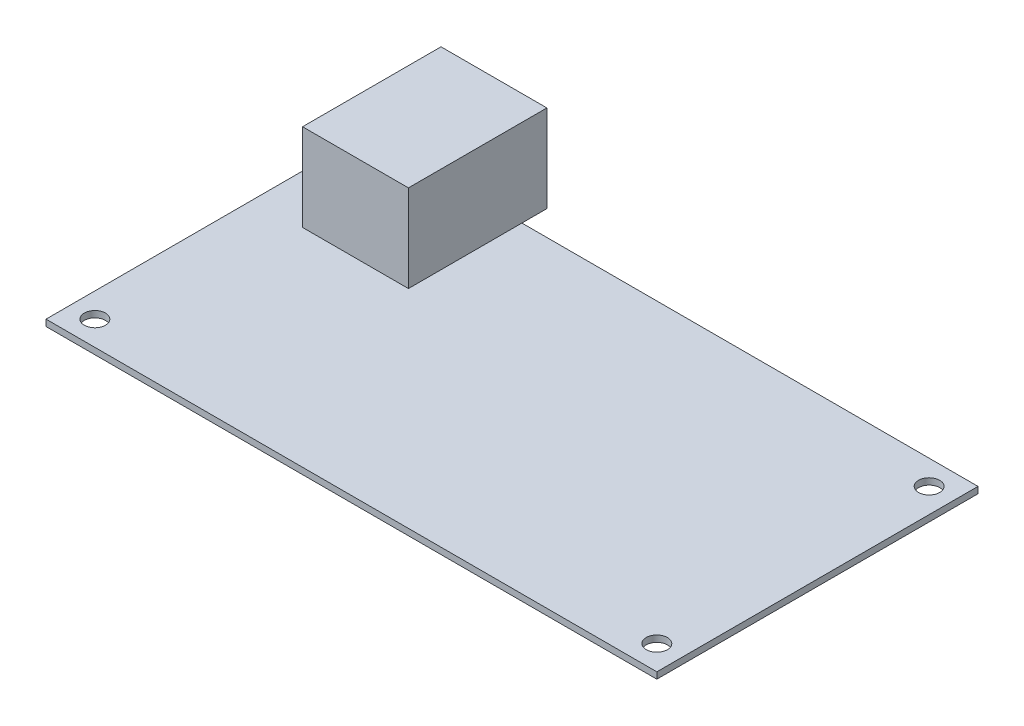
ISO-10303-21;
HEADER;
FILE_DESCRIPTION(('STEP AP214'),'2;1');
FILE_NAME('part.step','',(''),(''),'','','');
FILE_SCHEMA(('AUTOMOTIVE_DESIGN { 1 0 10303 214 1 1 1 1 }'));
ENDSEC;
DATA;
#1=APPLICATION_CONTEXT('core data for automotive mechanical design processes');
#2=APPLICATION_PROTOCOL_DEFINITION('international standard','automotive_design',2000,#1);
#3=PRODUCT_CONTEXT('',#1,'mechanical');
#4=PRODUCT('Part','Part','',(#3));
#5=PRODUCT_RELATED_PRODUCT_CATEGORY('part','',(#4));
#6=PRODUCT_DEFINITION_FORMATION('','',#4);
#7=PRODUCT_DEFINITION_CONTEXT('part definition',#1,'design');
#8=PRODUCT_DEFINITION('design','',#6,#7);
#9=PRODUCT_DEFINITION_SHAPE('','',#8);
#10=(LENGTH_UNIT() NAMED_UNIT(*) SI_UNIT(.MILLI.,.METRE.));
#11=(NAMED_UNIT(*) PLANE_ANGLE_UNIT() SI_UNIT($,.RADIAN.));
#12=(NAMED_UNIT(*) SI_UNIT($,.STERADIAN.) SOLID_ANGLE_UNIT());
#13=UNCERTAINTY_MEASURE_WITH_UNIT(LENGTH_MEASURE(1.E-05),#10,'distance_accuracy_value','');
#14=(GEOMETRIC_REPRESENTATION_CONTEXT(3) GLOBAL_UNCERTAINTY_ASSIGNED_CONTEXT((#13)) GLOBAL_UNIT_ASSIGNED_CONTEXT((#10,
#11,#12)) REPRESENTATION_CONTEXT('',''));
#15=CARTESIAN_POINT('',(0.,0.,0.));
#16=DIRECTION('',(0.,0.,1.));
#17=DIRECTION('',(1.,0.,0.));
#18=AXIS2_PLACEMENT_3D('',#15,#16,#17);
#19=CARTESIAN_POINT('',(0.,1.,-50.08));
#20=DIRECTION('',(0.,-1.,0.));
#21=DIRECTION('',(0.,0.,-1.));
#22=AXIS2_PLACEMENT_3D('',#19,#20,#21);
#23=PLANE('',#22);
#24=CARTESIAN_POINT('',(91.44,1.,-3.81));
#25=DIRECTION('',(0.,1.,0.));
#26=DIRECTION('',(0.,0.,1.));
#27=AXIS2_PLACEMENT_3D('',#24,#25,#26);
#28=CIRCLE('',#27,1.65);
#29=CARTESIAN_POINT('',(91.44,1.,-2.16));
#30=VERTEX_POINT('',#29);
#31=EDGE_CURVE('E130',#30,#30,#28,.T.);
#32=ORIENTED_EDGE('',*,*,#31,.F.);
#33=EDGE_LOOP('',(#32));
#34=FACE_BOUND('',#33,.T.);
#35=CARTESIAN_POINT('',(3.81,1.,-46.27));
#36=DIRECTION('',(0.,1.,0.));
#37=DIRECTION('',(0.,0.,1.));
#38=AXIS2_PLACEMENT_3D('',#35,#36,#37);
#39=CIRCLE('',#38,1.65);
#40=CARTESIAN_POINT('',(3.81,1.,-44.62));
#41=VERTEX_POINT('',#40);
#42=EDGE_CURVE('E145',#41,#41,#39,.T.);
#43=ORIENTED_EDGE('',*,*,#42,.F.);
#44=EDGE_LOOP('',(#43));
#45=FACE_BOUND('',#44,.T.);
#46=CARTESIAN_POINT('',(3.81,1.,-3.81));
#47=DIRECTION('',(0.,1.,0.));
#48=DIRECTION('',(0.,0.,1.));
#49=AXIS2_PLACEMENT_3D('',#46,#47,#48);
#50=CIRCLE('',#49,1.65);
#51=CARTESIAN_POINT('',(3.81,1.,-2.16));
#52=VERTEX_POINT('',#51);
#53=EDGE_CURVE('E151',#52,#52,#50,.T.);
#54=ORIENTED_EDGE('',*,*,#53,.F.);
#55=EDGE_LOOP('',(#54));
#56=FACE_BOUND('',#55,.T.);
#57=CARTESIAN_POINT('',(91.44,1.,-46.27));
#58=DIRECTION('',(0.,1.,0.));
#59=DIRECTION('',(0.,0.,1.));
#60=AXIS2_PLACEMENT_3D('',#57,#58,#59);
#61=CIRCLE('',#60,1.65);
#62=CARTESIAN_POINT('',(91.44,1.,-44.62));
#63=VERTEX_POINT('',#62);
#64=EDGE_CURVE('E139',#63,#63,#61,.T.);
#65=ORIENTED_EDGE('',*,*,#64,.F.);
#66=EDGE_LOOP('',(#65));
#67=FACE_BOUND('',#66,.T.);
#68=DIRECTION('',(0.,0.,-1.));
#69=VECTOR('',#68,1.);
#70=CARTESIAN_POINT('',(24.13,1.,-32.385));
#71=LINE('',#70,#69);
#72=CARTESIAN_POINT('',(24.13,1.,-32.385));
#73=VERTEX_POINT('',#72);
#74=CARTESIAN_POINT('',(24.13,1.,-50.08));
#75=VERTEX_POINT('',#74);
#76=EDGE_CURVE('E48',#73,#75,#71,.T.);
#77=ORIENTED_EDGE('',*,*,#76,.F.);
#78=DIRECTION('',(1.,0.,0.));
#79=VECTOR('',#78,1.);
#80=CARTESIAN_POINT('',(7.62,1.,-32.385));
#81=LINE('',#80,#79);
#82=CARTESIAN_POINT('',(7.62,1.,-32.385));
#83=VERTEX_POINT('',#82);
#84=EDGE_CURVE('E121',#83,#73,#81,.T.);
#85=ORIENTED_EDGE('',*,*,#84,.F.);
#86=DIRECTION('',(0.,0.,1.));
#87=VECTOR('',#86,1.);
#88=CARTESIAN_POINT('',(7.62,1.,-32.385));
#89=LINE('',#88,#87);
#90=CARTESIAN_POINT('',(7.62,1.,-50.08));
#91=VERTEX_POINT('',#90);
#92=EDGE_CURVE('E11',#91,#83,#89,.T.);
#93=ORIENTED_EDGE('',*,*,#92,.F.);
#94=DIRECTION('',(-1.,0.,0.));
#95=VECTOR('',#94,1.);
#96=CARTESIAN_POINT('',(0.,1.,-50.08));
#97=LINE('',#96,#95);
#98=CARTESIAN_POINT('',(0.,1.,-50.08));
#99=VERTEX_POINT('',#98);
#100=EDGE_CURVE('E165',#91,#99,#97,.T.);
#101=ORIENTED_EDGE('',*,*,#100,.T.);
#102=DIRECTION('',(0.,0.,1.));
#103=VECTOR('',#102,1.);
#104=CARTESIAN_POINT('',(0.,1.,0.));
#105=LINE('',#104,#103);
#106=CARTESIAN_POINT('',(0.,1.,0.));
#107=VERTEX_POINT('',#106);
#108=EDGE_CURVE('E157',#99,#107,#105,.T.);
#109=ORIENTED_EDGE('',*,*,#108,.T.);
#110=DIRECTION('',(1.,0.,0.));
#111=VECTOR('',#110,1.);
#112=CARTESIAN_POINT('',(0.,1.,0.));
#113=LINE('',#112,#111);
#114=CARTESIAN_POINT('',(95.25,1.,0.));
#115=VERTEX_POINT('',#114);
#116=EDGE_CURVE('E160',#107,#115,#113,.T.);
#117=ORIENTED_EDGE('',*,*,#116,.T.);
#118=DIRECTION('',(0.,0.,-1.));
#119=VECTOR('',#118,1.);
#120=CARTESIAN_POINT('',(95.25,1.,0.));
#121=LINE('',#120,#119);
#122=CARTESIAN_POINT('',(95.25,1.,-50.08));
#123=VERTEX_POINT('',#122);
#124=EDGE_CURVE('E163',#115,#123,#121,.T.);
#125=ORIENTED_EDGE('',*,*,#124,.T.);
#126=EDGE_CURVE('E166',#123,#75,#97,.T.);
#127=ORIENTED_EDGE('',*,*,#126,.T.);
#128=EDGE_LOOP('',(#77,#85,#93,#101,#109,#117,#125,#127));
#129=FACE_BOUND('',#128,.T.);
#130=ADVANCED_FACE('F31',(#34,#45,#56,#67,#129),#23,.F.);
#131=CARTESIAN_POINT('',(0.,0.,-50.08));
#132=DIRECTION('',(0.,-1.,0.));
#133=DIRECTION('',(0.,0.,-1.));
#134=AXIS2_PLACEMENT_3D('',#131,#132,#133);
#135=PLANE('',#134);
#136=CARTESIAN_POINT('',(91.44,0.,-46.27));
#137=DIRECTION('',(0.,1.,0.));
#138=DIRECTION('',(0.,0.,1.));
#139=AXIS2_PLACEMENT_3D('',#136,#137,#138);
#140=CIRCLE('',#139,1.65);
#141=CARTESIAN_POINT('',(91.44,0.,-44.62));
#142=VERTEX_POINT('',#141);
#143=EDGE_CURVE('E137',#142,#142,#140,.T.);
#144=ORIENTED_EDGE('',*,*,#143,.T.);
#145=EDGE_LOOP('',(#144));
#146=FACE_BOUND('',#145,.T.);
#147=CARTESIAN_POINT('',(3.81,0.,-3.81));
#148=DIRECTION('',(0.,1.,0.));
#149=DIRECTION('',(0.,0.,1.));
#150=AXIS2_PLACEMENT_3D('',#147,#148,#149);
#151=CIRCLE('',#150,1.65);
#152=CARTESIAN_POINT('',(3.81,0.,-2.16));
#153=VERTEX_POINT('',#152);
#154=EDGE_CURVE('E148',#153,#153,#151,.T.);
#155=ORIENTED_EDGE('',*,*,#154,.T.);
#156=EDGE_LOOP('',(#155));
#157=FACE_BOUND('',#156,.T.);
#158=DIRECTION('',(0.,0.,1.));
#159=VECTOR('',#158,1.);
#160=CARTESIAN_POINT('',(0.,0.,0.));
#161=LINE('',#160,#159);
#162=CARTESIAN_POINT('',(0.,0.,-50.08));
#163=VERTEX_POINT('',#162);
#164=CARTESIAN_POINT('',(0.,0.,0.));
#165=VERTEX_POINT('',#164);
#166=EDGE_CURVE('E154',#163,#165,#161,.T.);
#167=ORIENTED_EDGE('',*,*,#166,.F.);
#168=DIRECTION('',(-1.,0.,0.));
#169=VECTOR('',#168,1.);
#170=CARTESIAN_POINT('',(0.,0.,-50.08));
#171=LINE('',#170,#169);
#172=CARTESIAN_POINT('',(95.25,0.,-50.08));
#173=VERTEX_POINT('',#172);
#174=EDGE_CURVE('E161',#173,#163,#171,.T.);
#175=ORIENTED_EDGE('',*,*,#174,.F.);
#176=DIRECTION('',(0.,0.,-1.));
#177=VECTOR('',#176,1.);
#178=CARTESIAN_POINT('',(95.25,0.,0.));
#179=LINE('',#178,#177);
#180=CARTESIAN_POINT('',(95.25,0.,0.));
#181=VERTEX_POINT('',#180);
#182=EDGE_CURVE('E174',#181,#173,#179,.T.);
#183=ORIENTED_EDGE('',*,*,#182,.F.);
#184=DIRECTION('',(1.,0.,0.));
#185=VECTOR('',#184,1.);
#186=CARTESIAN_POINT('',(0.,0.,0.));
#187=LINE('',#186,#185);
#188=EDGE_CURVE('E172',#165,#181,#187,.T.);
#189=ORIENTED_EDGE('',*,*,#188,.F.);
#190=EDGE_LOOP('',(#167,#175,#183,#189));
#191=FACE_BOUND('',#190,.T.);
#192=CARTESIAN_POINT('',(3.81,0.,-46.27));
#193=DIRECTION('',(0.,1.,0.));
#194=DIRECTION('',(0.,0.,1.));
#195=AXIS2_PLACEMENT_3D('',#192,#193,#194);
#196=CIRCLE('',#195,1.65);
#197=CARTESIAN_POINT('',(3.81,0.,-44.62));
#198=VERTEX_POINT('',#197);
#199=EDGE_CURVE('E142',#198,#198,#196,.T.);
#200=ORIENTED_EDGE('',*,*,#199,.T.);
#201=EDGE_LOOP('',(#200));
#202=FACE_BOUND('',#201,.T.);
#203=CARTESIAN_POINT('',(91.44,0.,-3.81));
#204=DIRECTION('',(0.,1.,0.));
#205=DIRECTION('',(0.,0.,1.));
#206=AXIS2_PLACEMENT_3D('',#203,#204,#205);
#207=CIRCLE('',#206,1.65);
#208=CARTESIAN_POINT('',(91.44,0.,-2.16));
#209=VERTEX_POINT('',#208);
#210=EDGE_CURVE('E127',#209,#209,#207,.T.);
#211=ORIENTED_EDGE('',*,*,#210,.T.);
#212=EDGE_LOOP('',(#211));
#213=FACE_BOUND('',#212,.T.);
#214=ADVANCED_FACE('F197',(#146,#157,#191,#202,#213),#135,.T.);
#215=CARTESIAN_POINT('',(0.,1.,0.));
#216=DIRECTION('',(1.,0.,0.));
#217=DIRECTION('',(0.,0.,-1.));
#218=AXIS2_PLACEMENT_3D('',#215,#216,#217);
#219=PLANE('',#218);
#220=ORIENTED_EDGE('',*,*,#166,.T.);
#221=DIRECTION('',(0.,-1.,0.));
#222=VECTOR('',#221,1.);
#223=CARTESIAN_POINT('',(0.,1.,0.));
#224=LINE('',#223,#222);
#225=EDGE_CURVE('E35',#107,#165,#224,.T.);
#226=ORIENTED_EDGE('',*,*,#225,.F.);
#227=ORIENTED_EDGE('',*,*,#108,.F.);
#228=DIRECTION('',(0.,-1.,0.));
#229=VECTOR('',#228,1.);
#230=CARTESIAN_POINT('',(0.,1.,-50.08));
#231=LINE('',#230,#229);
#232=EDGE_CURVE('E168',#99,#163,#231,.T.);
#233=ORIENTED_EDGE('',*,*,#232,.T.);
#234=EDGE_LOOP('',(#220,#226,#227,#233));
#235=FACE_BOUND('',#234,.T.);
#236=ADVANCED_FACE('F33',(#235),#219,.F.);
#237=CARTESIAN_POINT('',(0.,1.,0.));
#238=DIRECTION('',(0.,0.,-1.));
#239=DIRECTION('',(-1.,0.,0.));
#240=AXIS2_PLACEMENT_3D('',#237,#238,#239);
#241=PLANE('',#240);
#242=ORIENTED_EDGE('',*,*,#188,.T.);
#243=DIRECTION('',(0.,-1.,0.));
#244=VECTOR('',#243,1.);
#245=CARTESIAN_POINT('',(95.25,1.,0.));
#246=LINE('',#245,#244);
#247=EDGE_CURVE('E181',#115,#181,#246,.T.);
#248=ORIENTED_EDGE('',*,*,#247,.F.);
#249=ORIENTED_EDGE('',*,*,#116,.F.);
#250=ORIENTED_EDGE('',*,*,#225,.T.);
#251=EDGE_LOOP('',(#242,#248,#249,#250));
#252=FACE_BOUND('',#251,.T.);
#253=ADVANCED_FACE('F190',(#252),#241,.F.);
#254=CARTESIAN_POINT('',(95.25,1.,0.));
#255=DIRECTION('',(-1.,0.,0.));
#256=DIRECTION('',(0.,0.,1.));
#257=AXIS2_PLACEMENT_3D('',#254,#255,#256);
#258=PLANE('',#257);
#259=ORIENTED_EDGE('',*,*,#182,.T.);
#260=DIRECTION('',(0.,-1.,0.));
#261=VECTOR('',#260,1.);
#262=CARTESIAN_POINT('',(95.25,1.,-50.08));
#263=LINE('',#262,#261);
#264=EDGE_CURVE('E179',#123,#173,#263,.T.);
#265=ORIENTED_EDGE('',*,*,#264,.F.);
#266=ORIENTED_EDGE('',*,*,#124,.F.);
#267=ORIENTED_EDGE('',*,*,#247,.T.);
#268=EDGE_LOOP('',(#259,#265,#266,#267));
#269=FACE_BOUND('',#268,.T.);
#270=ADVANCED_FACE('F200',(#269),#258,.F.);
#271=CARTESIAN_POINT('',(0.,1.,-50.08));
#272=DIRECTION('',(0.,0.,1.));
#273=DIRECTION('',(1.,0.,0.));
#274=AXIS2_PLACEMENT_3D('',#271,#272,#273);
#275=PLANE('',#274);
#276=ORIENTED_EDGE('',*,*,#174,.T.);
#277=ORIENTED_EDGE('',*,*,#232,.F.);
#278=ORIENTED_EDGE('',*,*,#100,.F.);
#279=EDGE_CURVE('E169',#75,#91,#97,.T.);
#280=ORIENTED_EDGE('',*,*,#279,.F.);
#281=ORIENTED_EDGE('',*,*,#126,.F.);
#282=ORIENTED_EDGE('',*,*,#264,.T.);
#283=EDGE_LOOP('',(#276,#277,#278,#280,#281,#282));
#284=FACE_BOUND('',#283,.T.);
#285=ADVANCED_FACE('F203',(#284),#275,.F.);
#286=CARTESIAN_POINT('',(3.81,1.,-3.81));
#287=DIRECTION('',(0.,-1.,0.));
#288=DIRECTION('',(0.,0.,-1.));
#289=AXIS2_PLACEMENT_3D('',#286,#287,#288);
#290=CYLINDRICAL_SURFACE('',#289,1.65);
#291=ORIENTED_EDGE('',*,*,#53,.T.);
#292=EDGE_LOOP('',(#291));
#293=FACE_BOUND('',#292,.T.);
#294=ORIENTED_EDGE('',*,*,#154,.F.);
#295=EDGE_LOOP('',(#294));
#296=FACE_BOUND('',#295,.T.);
#297=ADVANCED_FACE('F242',(#293,#296),#290,.F.);
#298=CARTESIAN_POINT('',(3.81,1.,-46.27));
#299=DIRECTION('',(0.,-1.,0.));
#300=DIRECTION('',(0.,0.,-1.));
#301=AXIS2_PLACEMENT_3D('',#298,#299,#300);
#302=CYLINDRICAL_SURFACE('',#301,1.65);
#303=ORIENTED_EDGE('',*,*,#42,.T.);
#304=EDGE_LOOP('',(#303));
#305=FACE_BOUND('',#304,.T.);
#306=ORIENTED_EDGE('',*,*,#199,.F.);
#307=EDGE_LOOP('',(#306));
#308=FACE_BOUND('',#307,.T.);
#309=ADVANCED_FACE('F285',(#305,#308),#302,.F.);
#310=CARTESIAN_POINT('',(91.44,1.,-46.27));
#311=DIRECTION('',(0.,-1.,0.));
#312=DIRECTION('',(0.,0.,-1.));
#313=AXIS2_PLACEMENT_3D('',#310,#311,#312);
#314=CYLINDRICAL_SURFACE('',#313,1.65);
#315=ORIENTED_EDGE('',*,*,#64,.T.);
#316=EDGE_LOOP('',(#315));
#317=FACE_BOUND('',#316,.T.);
#318=ORIENTED_EDGE('',*,*,#143,.F.);
#319=EDGE_LOOP('',(#318));
#320=FACE_BOUND('',#319,.T.);
#321=ADVANCED_FACE('F293',(#317,#320),#314,.F.);
#322=CARTESIAN_POINT('',(91.44,1.,-3.81));
#323=DIRECTION('',(0.,-1.,0.));
#324=DIRECTION('',(0.,0.,-1.));
#325=AXIS2_PLACEMENT_3D('',#322,#323,#324);
#326=CYLINDRICAL_SURFACE('',#325,1.65);
#327=ORIENTED_EDGE('',*,*,#31,.T.);
#328=EDGE_LOOP('',(#327));
#329=FACE_BOUND('',#328,.T.);
#330=ORIENTED_EDGE('',*,*,#210,.F.);
#331=EDGE_LOOP('',(#330));
#332=FACE_BOUND('',#331,.T.);
#333=ADVANCED_FACE('F301',(#329,#332),#326,.F.);
#334=CARTESIAN_POINT('',(24.13,14.6,-32.385));
#335=DIRECTION('',(-1.,0.,0.));
#336=DIRECTION('',(0.,0.,1.));
#337=AXIS2_PLACEMENT_3D('',#334,#335,#336);
#338=PLANE('',#337);
#339=ORIENTED_EDGE('',*,*,#76,.T.);
#340=CARTESIAN_POINT('',(24.13,1.,-53.975));
#341=VERTEX_POINT('',#340);
#342=EDGE_CURVE('E125',#75,#341,#71,.T.);
#343=ORIENTED_EDGE('',*,*,#342,.T.);
#344=DIRECTION('',(0.,-1.,0.));
#345=VECTOR('',#344,1.);
#346=CARTESIAN_POINT('',(24.13,14.6,-53.975));
#347=LINE('',#346,#345);
#348=CARTESIAN_POINT('',(24.13,14.6,-53.975));
#349=VERTEX_POINT('',#348);
#350=EDGE_CURVE('E106',#349,#341,#347,.T.);
#351=ORIENTED_EDGE('',*,*,#350,.F.);
#352=DIRECTION('',(0.,0.,-1.));
#353=VECTOR('',#352,1.);
#354=CARTESIAN_POINT('',(24.13,14.6,-32.385));
#355=LINE('',#354,#353);
#356=CARTESIAN_POINT('',(24.13,14.6,-32.385));
#357=VERTEX_POINT('',#356);
#358=EDGE_CURVE('E112',#357,#349,#355,.T.);
#359=ORIENTED_EDGE('',*,*,#358,.F.);
#360=DIRECTION('',(0.,-1.,0.));
#361=VECTOR('',#360,1.);
#362=CARTESIAN_POINT('',(24.13,14.6,-32.385));
#363=LINE('',#362,#361);
#364=EDGE_CURVE('E211',#357,#73,#363,.T.);
#365=ORIENTED_EDGE('',*,*,#364,.T.);
#366=EDGE_LOOP('',(#339,#343,#351,#359,#365));
#367=FACE_BOUND('',#366,.T.);
#368=ADVANCED_FACE('F123',(#367),#338,.F.);
#369=CARTESIAN_POINT('',(7.62,14.6,-53.975));
#370=DIRECTION('',(0.,0.,1.));
#371=DIRECTION('',(1.,0.,0.));
#372=AXIS2_PLACEMENT_3D('',#369,#370,#371);
#373=PLANE('',#372);
#374=DIRECTION('',(-1.,0.,0.));
#375=VECTOR('',#374,1.);
#376=CARTESIAN_POINT('',(7.62,1.,-53.975));
#377=LINE('',#376,#375);
#378=CARTESIAN_POINT('',(7.62,1.,-53.975));
#379=VERTEX_POINT('',#378);
#380=EDGE_CURVE('E209',#341,#379,#377,.T.);
#381=ORIENTED_EDGE('',*,*,#380,.T.);
#382=DIRECTION('',(0.,-1.,0.));
#383=VECTOR('',#382,1.);
#384=CARTESIAN_POINT('',(7.62,14.6,-53.975));
#385=LINE('',#384,#383);
#386=CARTESIAN_POINT('',(7.62,14.6,-53.975));
#387=VERTEX_POINT('',#386);
#388=EDGE_CURVE('E108',#387,#379,#385,.T.);
#389=ORIENTED_EDGE('',*,*,#388,.F.);
#390=DIRECTION('',(-1.,0.,0.));
#391=VECTOR('',#390,1.);
#392=CARTESIAN_POINT('',(7.62,14.6,-53.975));
#393=LINE('',#392,#391);
#394=EDGE_CURVE('E102',#349,#387,#393,.T.);
#395=ORIENTED_EDGE('',*,*,#394,.F.);
#396=ORIENTED_EDGE('',*,*,#350,.T.);
#397=EDGE_LOOP('',(#381,#389,#395,#396));
#398=FACE_BOUND('',#397,.T.);
#399=ADVANCED_FACE('F104',(#398),#373,.F.);
#400=CARTESIAN_POINT('',(7.62,14.6,-32.385));
#401=DIRECTION('',(1.,0.,0.));
#402=DIRECTION('',(0.,0.,-1.));
#403=AXIS2_PLACEMENT_3D('',#400,#401,#402);
#404=PLANE('',#403);
#405=EDGE_CURVE('E41',#379,#91,#89,.T.);
#406=ORIENTED_EDGE('',*,*,#405,.T.);
#407=ORIENTED_EDGE('',*,*,#92,.T.);
#408=DIRECTION('',(0.,-1.,0.));
#409=VECTOR('',#408,1.);
#410=CARTESIAN_POINT('',(7.62,14.6,-32.385));
#411=LINE('',#410,#409);
#412=CARTESIAN_POINT('',(7.62,14.6,-32.385));
#413=VERTEX_POINT('',#412);
#414=EDGE_CURVE('E132',#413,#83,#411,.T.);
#415=ORIENTED_EDGE('',*,*,#414,.F.);
#416=DIRECTION('',(0.,0.,1.));
#417=VECTOR('',#416,1.);
#418=CARTESIAN_POINT('',(7.62,14.6,-32.385));
#419=LINE('',#418,#417);
#420=EDGE_CURVE('E111',#387,#413,#419,.T.);
#421=ORIENTED_EDGE('',*,*,#420,.F.);
#422=ORIENTED_EDGE('',*,*,#388,.T.);
#423=EDGE_LOOP('',(#406,#407,#415,#421,#422));
#424=FACE_BOUND('',#423,.T.);
#425=ADVANCED_FACE('F222',(#424),#404,.F.);
#426=CARTESIAN_POINT('',(7.62,14.6,-32.385));
#427=DIRECTION('',(0.,0.,-1.));
#428=DIRECTION('',(-1.,0.,0.));
#429=AXIS2_PLACEMENT_3D('',#426,#427,#428);
#430=PLANE('',#429);
#431=ORIENTED_EDGE('',*,*,#84,.T.);
#432=ORIENTED_EDGE('',*,*,#364,.F.);
#433=DIRECTION('',(1.,0.,0.));
#434=VECTOR('',#433,1.);
#435=CARTESIAN_POINT('',(7.62,14.6,-32.385));
#436=LINE('',#435,#434);
#437=EDGE_CURVE('E117',#413,#357,#436,.T.);
#438=ORIENTED_EDGE('',*,*,#437,.F.);
#439=ORIENTED_EDGE('',*,*,#414,.T.);
#440=EDGE_LOOP('',(#431,#432,#438,#439));
#441=FACE_BOUND('',#440,.T.);
#442=ADVANCED_FACE('F220',(#441),#430,.F.);
#443=CARTESIAN_POINT('',(24.13,14.6,-53.975));
#444=DIRECTION('',(0.,-1.,0.));
#445=DIRECTION('',(0.,0.,-1.));
#446=AXIS2_PLACEMENT_3D('',#443,#444,#445);
#447=PLANE('',#446);
#448=ORIENTED_EDGE('',*,*,#358,.T.);
#449=ORIENTED_EDGE('',*,*,#394,.T.);
#450=ORIENTED_EDGE('',*,*,#420,.T.);
#451=ORIENTED_EDGE('',*,*,#437,.T.);
#452=EDGE_LOOP('',(#448,#449,#450,#451));
#453=FACE_BOUND('',#452,.T.);
#454=ADVANCED_FACE('F115',(#453),#447,.F.);
#455=CARTESIAN_POINT('',(24.13,1.,-53.975));
#456=DIRECTION('',(0.,-1.,0.));
#457=DIRECTION('',(0.,0.,-1.));
#458=AXIS2_PLACEMENT_3D('',#455,#456,#457);
#459=PLANE('',#458);
#460=ORIENTED_EDGE('',*,*,#342,.F.);
#461=ORIENTED_EDGE('',*,*,#279,.T.);
#462=ORIENTED_EDGE('',*,*,#405,.F.);
#463=ORIENTED_EDGE('',*,*,#380,.F.);
#464=EDGE_LOOP('',(#460,#461,#462,#463));
#465=FACE_BOUND('',#464,.T.);
#466=ADVANCED_FACE('F206',(#465),#459,.T.);
#467=CLOSED_SHELL('',(#130,#214,#236,#253,#270,#285,#297,#309,#321,#333,#368,#399,#425,#442,
#454,#466));
#468=MANIFOLD_SOLID_BREP('B2',#467);
#469=ADVANCED_BREP_SHAPE_REPRESENTATION('',(#18,#468),#14);
#470=SHAPE_DEFINITION_REPRESENTATION(#9,#469);
ENDSEC;
END-ISO-10303-21;
